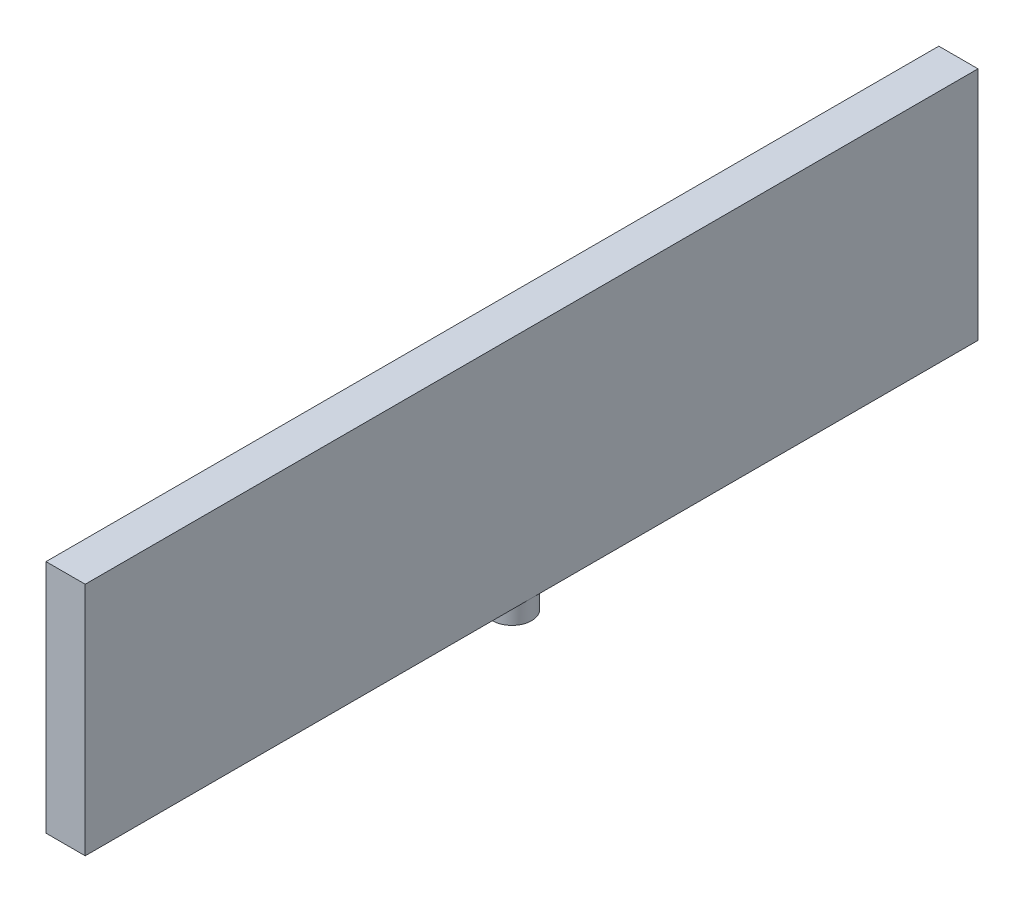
from build123d import *

# Parameters (mm, degrees)
SKETCH1_W      = 12.7
SKETCH1_H      = 76.2
EXTRUDE1_DEPTH = 289.221582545
SKETCH2_R      = 6.35
EXTRUDE2_DEPTH = 6.35


with BuildPart() as part:
    # Sketch1 → Extrude1 (new body)
    with BuildSketch(Plane.XY):
        with Locations((266.505867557, 329.820306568)):
            Rectangle(SKETCH1_W, SKETCH1_H)
    extrude(amount=-EXTRUDE1_DEPTH)

    # Sketch2 → Extrude2 (add)
    with BuildSketch(Plane.XZ.offset(-291.720306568)):
        with Locations(Location((266.505867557, -144.610791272, 0), (0, 0, 180))):
            Circle(SKETCH2_R)
    extrude(amount=EXTRUDE2_DEPTH)


solid = part.part
